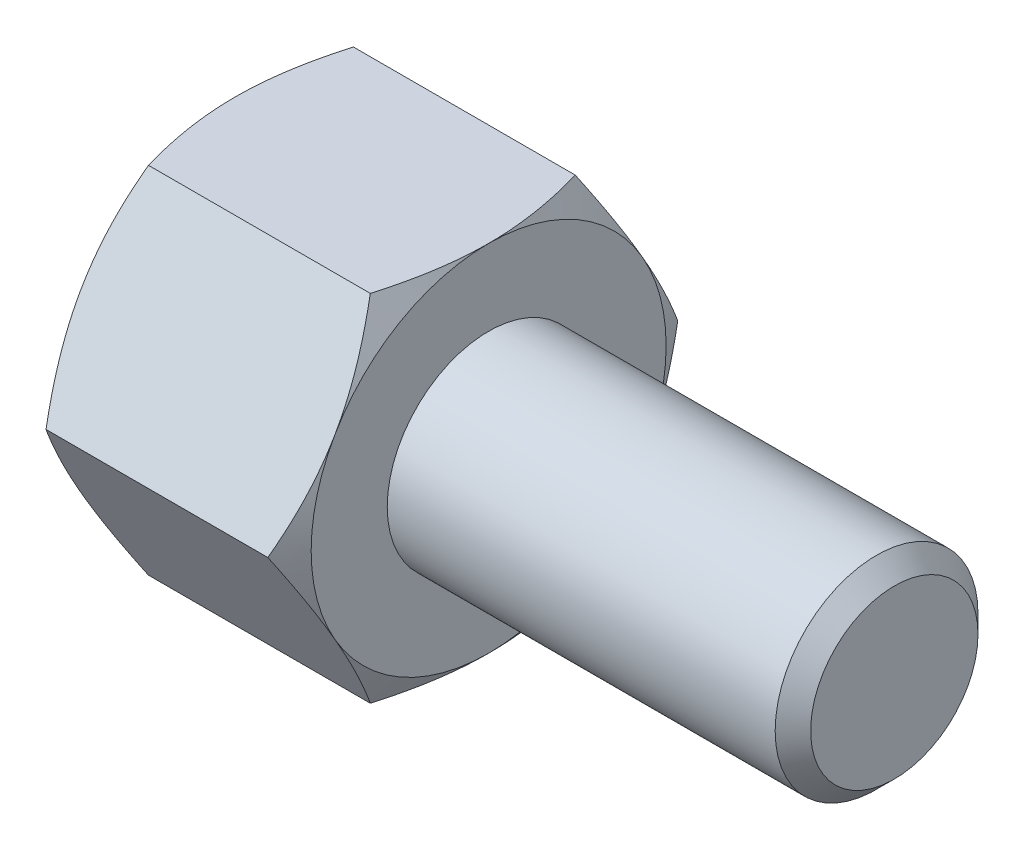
ISO-10303-21;
HEADER;
FILE_DESCRIPTION(('STEP AP214'),'2;1');
FILE_NAME('part.step','',(''),(''),'','','');
FILE_SCHEMA(('AUTOMOTIVE_DESIGN { 1 0 10303 214 1 1 1 1 }'));
ENDSEC;
DATA;
#1=APPLICATION_CONTEXT('core data for automotive mechanical design processes');
#2=APPLICATION_PROTOCOL_DEFINITION('international standard','automotive_design',2000,#1);
#3=PRODUCT_CONTEXT('',#1,'mechanical');
#4=PRODUCT('Part','Part','',(#3));
#5=PRODUCT_RELATED_PRODUCT_CATEGORY('part','',(#4));
#6=PRODUCT_DEFINITION_FORMATION('','',#4);
#7=PRODUCT_DEFINITION_CONTEXT('part definition',#1,'design');
#8=PRODUCT_DEFINITION('design','',#6,#7);
#9=PRODUCT_DEFINITION_SHAPE('','',#8);
#10=(LENGTH_UNIT() NAMED_UNIT(*) SI_UNIT(.MILLI.,.METRE.));
#11=(NAMED_UNIT(*) PLANE_ANGLE_UNIT() SI_UNIT($,.RADIAN.));
#12=(NAMED_UNIT(*) SI_UNIT($,.STERADIAN.) SOLID_ANGLE_UNIT());
#13=UNCERTAINTY_MEASURE_WITH_UNIT(LENGTH_MEASURE(1.E-05),#10,'distance_accuracy_value','');
#14=(GEOMETRIC_REPRESENTATION_CONTEXT(3) GLOBAL_UNCERTAINTY_ASSIGNED_CONTEXT((#13)) GLOBAL_UNIT_ASSIGNED_CONTEXT((#10,
#11,#12)) REPRESENTATION_CONTEXT('',''));
#15=CARTESIAN_POINT('',(0.,0.,0.));
#16=DIRECTION('',(0.,0.,1.));
#17=DIRECTION('',(1.,0.,0.));
#18=AXIS2_PLACEMENT_3D('',#15,#16,#17);
#19=CARTESIAN_POINT('',(2.5,3.5,-2.02072594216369));
#20=DIRECTION('',(1.,0.,0.));
#21=DIRECTION('',(0.,0.,-1.));
#22=AXIS2_PLACEMENT_3D('',#19,#20,#21);
#23=PLANE('',#22);
#24=CARTESIAN_POINT('',(2.5,0.,0.));
#25=DIRECTION('',(1.,0.,0.));
#26=DIRECTION('',(0.,0.,-1.));
#27=AXIS2_PLACEMENT_3D('',#24,#25,#26);
#28=CIRCLE('',#27,3.5);
#29=CARTESIAN_POINT('',(2.5,-1.75,-3.03108891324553));
#30=VERTEX_POINT('',#29);
#31=CARTESIAN_POINT('',(2.5,1.75,-3.03108891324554));
#32=VERTEX_POINT('',#31);
#33=EDGE_CURVE('E288',#30,#32,#28,.T.);
#34=ORIENTED_EDGE('',*,*,#33,.T.);
#35=CARTESIAN_POINT('',(2.5,3.5,0.));
#36=VERTEX_POINT('',#35);
#37=EDGE_CURVE('E53',#32,#36,#28,.T.);
#38=ORIENTED_EDGE('',*,*,#37,.T.);
#39=CARTESIAN_POINT('',(2.5,1.75,3.03108891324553));
#40=VERTEX_POINT('',#39);
#41=EDGE_CURVE('E297',#36,#40,#28,.T.);
#42=ORIENTED_EDGE('',*,*,#41,.T.);
#43=CARTESIAN_POINT('',(2.5,-1.75,3.03108891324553));
#44=VERTEX_POINT('',#43);
#45=EDGE_CURVE('E302',#40,#44,#28,.T.);
#46=ORIENTED_EDGE('',*,*,#45,.T.);
#47=CARTESIAN_POINT('',(2.5,0.,0.));
#48=DIRECTION('',(-1.,0.,0.));
#49=DIRECTION('',(0.,-1.,0.));
#50=AXIS2_PLACEMENT_3D('',#47,#48,#49);
#51=CIRCLE('',#50,3.5);
#52=CARTESIAN_POINT('',(2.5,-3.5,0.));
#53=VERTEX_POINT('',#52);
#54=EDGE_CURVE('E193',#53,#44,#51,.T.);
#55=ORIENTED_EDGE('',*,*,#54,.F.);
#56=EDGE_CURVE('E61',#53,#30,#28,.T.);
#57=ORIENTED_EDGE('',*,*,#56,.T.);
#58=EDGE_LOOP('',(#34,#38,#42,#46,#55,#57));
#59=FACE_BOUND('',#58,.T.);
#60=CARTESIAN_POINT('',(2.5,0.,0.));
#61=DIRECTION('',(1.,0.,0.));
#62=DIRECTION('',(0.,0.,-1.));
#63=AXIS2_PLACEMENT_3D('',#60,#61,#62);
#64=CIRCLE('',#63,2.);
#65=CARTESIAN_POINT('',(2.5,0.,-2.));
#66=VERTEX_POINT('',#65);
#67=EDGE_CURVE('E314',#66,#66,#64,.T.);
#68=ORIENTED_EDGE('',*,*,#67,.F.);
#69=EDGE_LOOP('',(#68));
#70=FACE_BOUND('',#69,.T.);
#71=ADVANCED_FACE('F37',(#59,#70),#23,.T.);
#72=CARTESIAN_POINT('',(2.5,0.,-4.04145188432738));
#73=DIRECTION('',(0.,-0.5,0.866025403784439));
#74=DIRECTION('',(0.,-0.866025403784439,-0.5));
#75=AXIS2_PLACEMENT_3D('',#72,#73,#74);
#76=PLANE('',#75);
#77=CARTESIAN_POINT('',(2.18732593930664,-0.000200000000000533,-4.04156735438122));
#78=CARTESIAN_POINT('',(2.23861421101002,0.153607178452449,-3.9527667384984));
#79=CARTESIAN_POINT('',(2.28525904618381,0.308742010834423,-3.86319960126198));
#80=CARTESIAN_POINT('',(2.36667812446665,0.62169800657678,-3.68251437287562));
#81=CARTESIAN_POINT('',(2.40142356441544,0.779524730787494,-3.59139307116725));
#82=CARTESIAN_POINT('',(2.45550997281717,1.09322221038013,-3.41027974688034));
#83=CARTESIAN_POINT('',(2.47521091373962,1.24904469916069,-3.32031559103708));
#84=CARTESIAN_POINT('',(2.49872986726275,1.56142288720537,-3.13996396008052));
#85=CARTESIAN_POINT('',(2.50256735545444,1.71797745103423,-3.04957714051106));
#86=CARTESIAN_POINT('',(2.49458469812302,2.01050921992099,-2.88068384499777));
#87=CARTESIAN_POINT('',(2.4847245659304,2.1465302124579,-2.80215208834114));
#88=CARTESIAN_POINT('',(2.4534735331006,2.41768602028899,-2.64560020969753));
#89=CARTESIAN_POINT('',(2.43207195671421,2.55281989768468,-2.5675806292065));
#90=CARTESIAN_POINT('',(2.37856959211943,2.82453479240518,-2.41070596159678));
#91=CARTESIAN_POINT('',(2.34624200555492,2.96108141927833,-2.33187072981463));
#92=CARTESIAN_POINT('',(2.27287106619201,3.2321380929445,-2.17537608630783));
#93=CARTESIAN_POINT('',(2.23184495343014,3.36665161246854,-2.09771466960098));
#94=CARTESIAN_POINT('',(2.18732593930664,3.5002,-2.02061047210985));
#95=B_SPLINE_CURVE_WITH_KNOTS('',3,(#77,#78,#79,#80,#81,#82,#83,#84,#85,#86,#87,#88,#89,#90,#91,
#92,#93,#94),.UNSPECIFIED.,.F.,.F.,(4,2,2,2,2,2,2,2,4),(0.,0.554793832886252,1.11092123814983,
1.65328467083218,2.19498204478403,2.6666513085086,3.13875761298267,3.62133612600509,
4.10296698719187),.UNSPECIFIED.);
#96=CARTESIAN_POINT('',(2.18739260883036,0.,-4.04145188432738));
#97=VERTEX_POINT('',#96);
#98=EDGE_CURVE('E319',#97,#32,#95,.T.);
#99=ORIENTED_EDGE('',*,*,#98,.F.);
#100=DIRECTION('',(-1.,0.,0.));
#101=VECTOR('',#100,1.);
#102=CARTESIAN_POINT('',(2.5,0.,-4.04145188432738));
#103=LINE('',#102,#101);
#104=CARTESIAN_POINT('',(-2.18739260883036,0.,-4.04145188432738));
#105=VERTEX_POINT('',#104);
#106=EDGE_CURVE('E264',#97,#105,#103,.T.);
#107=ORIENTED_EDGE('',*,*,#106,.T.);
#108=CARTESIAN_POINT('',(-2.18732593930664,3.5002,-2.02061047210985));
#109=CARTESIAN_POINT('',(-2.23861421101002,3.34639282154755,-2.10941108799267));
#110=CARTESIAN_POINT('',(-2.28525904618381,3.19125798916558,-2.19897822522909));
#111=CARTESIAN_POINT('',(-2.36667812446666,2.87830199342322,-2.37966345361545));
#112=CARTESIAN_POINT('',(-2.40142356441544,2.7204752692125,-2.47078475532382));
#113=CARTESIAN_POINT('',(-2.45550997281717,2.40677778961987,-2.65189807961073));
#114=CARTESIAN_POINT('',(-2.47521091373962,2.25095530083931,-2.74186223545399));
#115=CARTESIAN_POINT('',(-2.49872986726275,1.93857711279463,-2.92221386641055));
#116=CARTESIAN_POINT('',(-2.50256735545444,1.78202254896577,-3.01260068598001));
#117=CARTESIAN_POINT('',(-2.49458469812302,1.48949078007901,-3.1814939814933));
#118=CARTESIAN_POINT('',(-2.4847245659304,1.3534697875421,-3.26002573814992));
#119=CARTESIAN_POINT('',(-2.4534735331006,1.08231397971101,-3.41657761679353));
#120=CARTESIAN_POINT('',(-2.4320719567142,0.947180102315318,-3.49459719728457));
#121=CARTESIAN_POINT('',(-2.37856959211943,0.675465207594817,-3.65147186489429));
#122=CARTESIAN_POINT('',(-2.34624200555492,0.538918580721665,-3.73030709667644));
#123=CARTESIAN_POINT('',(-2.27287106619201,0.267861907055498,-3.88680174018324));
#124=CARTESIAN_POINT('',(-2.23184495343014,0.133348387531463,-3.96446315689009));
#125=CARTESIAN_POINT('',(-2.18732593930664,-0.000200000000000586,-4.04156735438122));
#126=B_SPLINE_CURVE_WITH_KNOTS('',3,(#108,#109,#110,#111,#112,#113,#114,#115,#116,#117,#118,
#119,#120,#121,#122,#123,#124,#125),.UNSPECIFIED.,.F.,.F.,(4,2,2,2,2,2,2,2,4),(0.,
0.554793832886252,1.11092123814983,1.65328467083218,2.19498204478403,2.6666513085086,
3.13875761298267,3.62133612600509,4.10296698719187),.UNSPECIFIED.);
#127=CARTESIAN_POINT('',(-2.5,1.75,-3.03108891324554));
#128=VERTEX_POINT('',#127);
#129=EDGE_CURVE('E324',#128,#105,#126,.T.);
#130=ORIENTED_EDGE('',*,*,#129,.F.);
#131=CARTESIAN_POINT('',(-2.18739260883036,3.5,-2.02072594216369));
#132=VERTEX_POINT('',#131);
#133=EDGE_CURVE('E321',#132,#128,#126,.T.);
#134=ORIENTED_EDGE('',*,*,#133,.F.);
#135=DIRECTION('',(-1.,0.,0.));
#136=VECTOR('',#135,1.);
#137=CARTESIAN_POINT('',(2.5,3.5,-2.02072594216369));
#138=LINE('',#137,#136);
#139=CARTESIAN_POINT('',(2.18739260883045,3.5,-2.02072594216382));
#140=VERTEX_POINT('',#139);
#141=EDGE_CURVE('E279',#140,#132,#138,.T.);
#142=ORIENTED_EDGE('',*,*,#141,.F.);
#143=EDGE_CURVE('E229',#32,#140,#95,.T.);
#144=ORIENTED_EDGE('',*,*,#143,.F.);
#145=EDGE_LOOP('',(#99,#107,#130,#134,#142,#144));
#146=FACE_BOUND('',#145,.T.);
#147=ADVANCED_FACE('F148',(#146),#76,.F.);
#148=CARTESIAN_POINT('',(2.5,3.5,-2.02072594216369));
#149=DIRECTION('',(0.,-1.,0.));
#150=DIRECTION('',(0.,0.,-1.));
#151=AXIS2_PLACEMENT_3D('',#148,#149,#150);
#152=PLANE('',#151);
#153=CARTESIAN_POINT('',(0.744329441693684,3.5,-5.52571367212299));
#154=CARTESIAN_POINT('',(0.819281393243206,3.5,-5.37200190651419));
#155=CARTESIAN_POINT('',(0.893542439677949,3.5,-5.21794762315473));
#156=CARTESIAN_POINT('',(1.04029601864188,3.5,-4.90897223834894));
#157=CARTESIAN_POINT('',(1.11278829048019,3.5,-4.75405101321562));
#158=CARTESIAN_POINT('',(1.25596172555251,3.5,-4.44240758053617));
#159=CARTESIAN_POINT('',(1.32663168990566,3.5,-4.28568021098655));
#160=CARTESIAN_POINT('',(1.46520746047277,3.5,-3.97101270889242));
#161=CARTESIAN_POINT('',(1.53311339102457,3.5,-3.81307263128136));
#162=CARTESIAN_POINT('',(1.66771439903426,3.5,-3.49026114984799));
#163=CARTESIAN_POINT('',(1.73428710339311,3.5,-3.32533845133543));
#164=CARTESIAN_POINT('',(1.86262677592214,3.5,-2.99359992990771));
#165=CARTESIAN_POINT('',(1.92439321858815,3.5,-2.82678390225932));
#166=CARTESIAN_POINT('',(2.04157006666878,3.5,-2.49127529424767));
#167=CARTESIAN_POINT('',(2.09699254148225,3.5,-2.32258697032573));
#168=CARTESIAN_POINT('',(2.19976794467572,3.5,-1.98279215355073));
#169=CARTESIAN_POINT('',(2.24712331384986,3.5,-1.81168640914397));
#170=CARTESIAN_POINT('',(2.33129873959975,3.5,-1.46793354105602));
#171=CARTESIAN_POINT('',(2.36817965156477,3.5,-1.2953015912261));
#172=CARTESIAN_POINT('',(2.42939557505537,3.5,-0.947791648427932));
#173=CARTESIAN_POINT('',(2.453731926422,3.5,-0.772913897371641));
#174=CARTESIAN_POINT('',(2.48760388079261,3.5,-0.424108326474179));
#175=CARTESIAN_POINT('',(2.49733725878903,3.5,-0.250200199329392));
#176=CARTESIAN_POINT('',(2.50170533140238,3.5,0.0978233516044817));
#177=CARTESIAN_POINT('',(2.49633996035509,3.5,0.27193877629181));
#178=CARTESIAN_POINT('',(2.47501181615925,3.5,0.564711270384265));
#179=CARTESIAN_POINT('',(2.46289198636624,3.5,0.683667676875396));
#180=CARTESIAN_POINT('',(2.43230809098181,3.5,0.920767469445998));
#181=CARTESIAN_POINT('',(2.41384324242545,3.5,1.03891075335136));
#182=CARTESIAN_POINT('',(2.34989562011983,3.5,1.39193174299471));
#183=CARTESIAN_POINT('',(2.29586958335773,3.5,1.62528232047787));
#184=CARTESIAN_POINT('',(2.20145152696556,3.5,1.97433825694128));
#185=CARTESIAN_POINT('',(2.16729009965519,3.5,2.09183268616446));
#186=CARTESIAN_POINT('',(2.09523444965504,3.5,2.32568238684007));
#187=CARTESIAN_POINT('',(2.05734019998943,3.5,2.44203765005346));
#188=CARTESIAN_POINT('',(1.97844216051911,3.5,2.67364238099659));
#189=CARTESIAN_POINT('',(1.93743925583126,3.5,2.78889215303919));
#190=CARTESIAN_POINT('',(1.85282457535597,3.5,3.01842460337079));
#191=CARTESIAN_POINT('',(1.8092128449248,3.5,3.1327072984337));
#192=CARTESIAN_POINT('',(1.69582414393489,3.5,3.42150510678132));
#193=CARTESIAN_POINT('',(1.62456360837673,3.5,3.59543696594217));
#194=CARTESIAN_POINT('',(1.47810267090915,3.5,3.94163961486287));
#195=CARTESIAN_POINT('',(1.40290192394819,3.5,4.11391025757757));
#196=CARTESIAN_POINT('',(1.24942525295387,3.5,4.45713072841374));
#197=CARTESIAN_POINT('',(1.17114846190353,3.5,4.62808016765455));
#198=CARTESIAN_POINT('',(1.01218826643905,3.5,4.9688584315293));
#199=CARTESIAN_POINT('',(0.931504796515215,3.5,5.13868722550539));
#200=CARTESIAN_POINT('',(0.686387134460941,3.5,5.64726192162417));
#201=CARTESIAN_POINT('',(0.519097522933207,3.5,5.98463020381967));
#202=CARTESIAN_POINT('',(0.179585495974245,3.5,6.65678495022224));
#203=CARTESIAN_POINT('',(0.0073639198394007,3.5,6.99157184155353));
#204=CARTESIAN_POINT('',(-0.323919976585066,3.5,7.62749570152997));
#205=CARTESIAN_POINT('',(-0.48267007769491,3.5,7.92879562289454));
#206=CARTESIAN_POINT('',(-0.802252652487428,3.5,8.53030635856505));
#207=CARTESIAN_POINT('',(-0.963085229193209,3.5,8.83051711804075));
#208=CARTESIAN_POINT('',(-1.28582073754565,3.5,9.42918006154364));
#209=CARTESIAN_POINT('',(-1.44771890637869,3.5,9.72763481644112));
#210=CARTESIAN_POINT('',(-1.77272623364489,3.5,10.3238577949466));
#211=CARTESIAN_POINT('',(-1.93583530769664,3.5,10.6216260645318));
#212=CARTESIAN_POINT('',(-2.09938958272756,3.5,10.9191478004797));
#213=B_SPLINE_CURVE_WITH_KNOTS('',3,(#153,#154,#155,#156,#157,#158,#159,#160,#161,#162,#163,
#164,#165,#166,#167,#168,#169,#170,#171,#172,#173,#174,#175,#176,#177,#178,#179,#180,#181,#182,
#183,#184,#185,#186,#187,#188,#189,#190,#191,#192,#193,#194,#195,#196,#197,#198,#199,#200,#201,
#202,#203,#204,#205,#206,#207,#208,#209,#210,#211,#212),.UNSPECIFIED.,.F.,.F.,(4,2,2,2,2,2,2,2,
2,2,2,2,2,2,2,2,2,2,2,2,2,2,2,2,2,2,2,2,2,4),(0.,0.513041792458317,1.02615874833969,
1.54190801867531,2.05763406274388,2.59113284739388,3.1246898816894,3.65721433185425,
4.18957737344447,4.71878103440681,5.247928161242,5.76984197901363,6.29175806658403,
6.65030258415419,7.0088913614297,7.72642330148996,8.09346920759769,8.46051776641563,
8.82746220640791,9.19440026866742,9.7582223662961,10.3220939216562,10.8861255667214,
11.4501725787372,12.579801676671,13.7092396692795,14.730918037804,15.7526471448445,
16.771258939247,17.7898004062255),.UNSPECIFIED.);
#214=EDGE_CURVE('E227',#140,#36,#213,.T.);
#215=ORIENTED_EDGE('',*,*,#214,.F.);
#216=ORIENTED_EDGE('',*,*,#141,.T.);
#217=CARTESIAN_POINT('',(-0.744329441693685,3.5,-5.52571367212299));
#218=CARTESIAN_POINT('',(-0.819281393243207,3.5,-5.37200190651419));
#219=CARTESIAN_POINT('',(-0.89354243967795,3.5,-5.21794762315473));
#220=CARTESIAN_POINT('',(-1.04029601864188,3.5,-4.90897223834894));
#221=CARTESIAN_POINT('',(-1.11278829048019,3.5,-4.75405101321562));
#222=CARTESIAN_POINT('',(-1.25596172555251,3.5,-4.44240758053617));
#223=CARTESIAN_POINT('',(-1.32663168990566,3.5,-4.28568021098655));
#224=CARTESIAN_POINT('',(-1.46520746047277,3.5,-3.97101270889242));
#225=CARTESIAN_POINT('',(-1.53311339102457,3.5,-3.81307263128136));
#226=CARTESIAN_POINT('',(-1.66771439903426,3.5,-3.49026114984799));
#227=CARTESIAN_POINT('',(-1.73428710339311,3.5,-3.32533845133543));
#228=CARTESIAN_POINT('',(-1.86262677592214,3.5,-2.99359992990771));
#229=CARTESIAN_POINT('',(-1.92439321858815,3.5,-2.82678390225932));
#230=CARTESIAN_POINT('',(-2.04157006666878,3.5,-2.49127529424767));
#231=CARTESIAN_POINT('',(-2.09699254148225,3.5,-2.32258697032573));
#232=CARTESIAN_POINT('',(-2.19976794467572,3.5,-1.98279215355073));
#233=CARTESIAN_POINT('',(-2.24712331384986,3.5,-1.81168640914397));
#234=CARTESIAN_POINT('',(-2.33129873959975,3.5,-1.46793354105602));
#235=CARTESIAN_POINT('',(-2.36817965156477,3.5,-1.2953015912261));
#236=CARTESIAN_POINT('',(-2.42939557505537,3.5,-0.947791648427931));
#237=CARTESIAN_POINT('',(-2.453731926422,3.5,-0.77291389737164));
#238=CARTESIAN_POINT('',(-2.48760388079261,3.5,-0.424108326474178));
#239=CARTESIAN_POINT('',(-2.49733725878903,3.5,-0.250200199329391));
#240=CARTESIAN_POINT('',(-2.50170533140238,3.5,0.0978233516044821));
#241=CARTESIAN_POINT('',(-2.49633996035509,3.5,0.27193877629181));
#242=CARTESIAN_POINT('',(-2.47501181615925,3.5,0.564711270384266));
#243=CARTESIAN_POINT('',(-2.46289198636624,3.5,0.683667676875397));
#244=CARTESIAN_POINT('',(-2.43230809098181,3.5,0.920767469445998));
#245=CARTESIAN_POINT('',(-2.41384324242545,3.5,1.03891075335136));
#246=CARTESIAN_POINT('',(-2.34989562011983,3.5,1.39193174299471));
#247=CARTESIAN_POINT('',(-2.29586958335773,3.5,1.62528232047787));
#248=CARTESIAN_POINT('',(-2.20145152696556,3.5,1.97433825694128));
#249=CARTESIAN_POINT('',(-2.16729009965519,3.5,2.09183268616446));
#250=CARTESIAN_POINT('',(-2.09523444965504,3.5,2.32568238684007));
#251=CARTESIAN_POINT('',(-2.05734019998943,3.5,2.44203765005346));
#252=CARTESIAN_POINT('',(-1.97844216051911,3.5,2.67364238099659));
#253=CARTESIAN_POINT('',(-1.93743925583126,3.5,2.78889215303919));
#254=CARTESIAN_POINT('',(-1.85282457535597,3.5,3.01842460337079));
#255=CARTESIAN_POINT('',(-1.8092128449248,3.5,3.1327072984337));
#256=CARTESIAN_POINT('',(-1.69582414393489,3.5,3.42150510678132));
#257=CARTESIAN_POINT('',(-1.62456360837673,3.5,3.59543696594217));
#258=CARTESIAN_POINT('',(-1.47810267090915,3.5,3.94163961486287));
#259=CARTESIAN_POINT('',(-1.40290192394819,3.5,4.11391025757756));
#260=CARTESIAN_POINT('',(-1.24942525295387,3.5,4.45713072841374));
#261=CARTESIAN_POINT('',(-1.17114846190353,3.5,4.62808016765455));
#262=CARTESIAN_POINT('',(-1.01218826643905,3.5,4.9688584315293));
#263=CARTESIAN_POINT('',(-0.931504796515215,3.5,5.13868722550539));
#264=CARTESIAN_POINT('',(-0.68638713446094,3.5,5.64726192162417));
#265=CARTESIAN_POINT('',(-0.519097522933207,3.5,5.98463020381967));
#266=CARTESIAN_POINT('',(-0.179585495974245,3.5,6.65678495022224));
#267=CARTESIAN_POINT('',(-0.00736391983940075,3.5,6.99157184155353));
#268=CARTESIAN_POINT('',(0.323919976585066,3.5,7.62749570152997));
#269=CARTESIAN_POINT('',(0.48267007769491,3.5,7.92879562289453));
#270=CARTESIAN_POINT('',(0.802252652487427,3.5,8.53030635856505));
#271=CARTESIAN_POINT('',(0.963085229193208,3.5,8.83051711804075));
#272=CARTESIAN_POINT('',(1.28582073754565,3.5,9.42918006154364));
#273=CARTESIAN_POINT('',(1.44771890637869,3.5,9.72763481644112));
#274=CARTESIAN_POINT('',(1.77272623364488,3.5,10.3238577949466));
#275=CARTESIAN_POINT('',(1.93583530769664,3.5,10.6216260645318));
#276=CARTESIAN_POINT('',(2.09938958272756,3.5,10.9191478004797));
#277=B_SPLINE_CURVE_WITH_KNOTS('',3,(#217,#218,#219,#220,#221,#222,#223,#224,#225,#226,#227,
#228,#229,#230,#231,#232,#233,#234,#235,#236,#237,#238,#239,#240,#241,#242,#243,#244,#245,#246,
#247,#248,#249,#250,#251,#252,#253,#254,#255,#256,#257,#258,#259,#260,#261,#262,#263,#264,#265,
#266,#267,#268,#269,#270,#271,#272,#273,#274,#275,#276),.UNSPECIFIED.,.F.,.F.,(4,2,2,2,2,2,2,2,
2,2,2,2,2,2,2,2,2,2,2,2,2,2,2,2,2,2,2,2,2,4),(0.,0.513041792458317,1.02615874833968,
1.5419080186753,2.05763406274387,2.59113284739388,3.1246898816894,3.65721433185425,
4.18957737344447,4.71878103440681,5.247928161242,5.76984197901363,6.29175806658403,
6.65030258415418,7.0088913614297,7.72642330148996,8.09346920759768,8.46051776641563,
8.82746220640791,9.19440026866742,9.75822236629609,10.3220939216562,10.8861255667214,
11.4501725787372,12.579801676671,13.7092396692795,14.730918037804,15.7526471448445,
16.7712589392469,17.7898004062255),.UNSPECIFIED.);
#278=CARTESIAN_POINT('',(-2.5,3.5,0.));
#279=VERTEX_POINT('',#278);
#280=EDGE_CURVE('E241',#279,#132,#277,.F.);
#281=ORIENTED_EDGE('',*,*,#280,.F.);
#282=CARTESIAN_POINT('',(-2.18739260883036,3.5,2.02072594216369));
#283=VERTEX_POINT('',#282);
#284=EDGE_CURVE('E249',#283,#279,#277,.F.);
#285=ORIENTED_EDGE('',*,*,#284,.F.);
#286=DIRECTION('',(-1.,0.,0.));
#287=VECTOR('',#286,1.);
#288=CARTESIAN_POINT('',(2.5,3.5,2.02072594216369));
#289=LINE('',#288,#287);
#290=CARTESIAN_POINT('',(2.18739260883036,3.5,2.02072594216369));
#291=VERTEX_POINT('',#290);
#292=EDGE_CURVE('E276',#291,#283,#289,.T.);
#293=ORIENTED_EDGE('',*,*,#292,.F.);
#294=EDGE_CURVE('E221',#36,#291,#213,.T.);
#295=ORIENTED_EDGE('',*,*,#294,.F.);
#296=EDGE_LOOP('',(#215,#216,#281,#285,#293,#295));
#297=FACE_BOUND('',#296,.T.);
#298=ADVANCED_FACE('F153',(#297),#152,.F.);
#299=CARTESIAN_POINT('',(2.5,3.5,2.02072594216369));
#300=DIRECTION('',(0.,-0.5,-0.866025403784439));
#301=DIRECTION('',(0.,0.866025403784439,-0.5));
#302=AXIS2_PLACEMENT_3D('',#299,#300,#301);
#303=PLANE('',#302);
#304=CARTESIAN_POINT('',(2.18732593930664,3.5002,2.02061047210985));
#305=CARTESIAN_POINT('',(2.23861421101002,3.34639282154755,2.10941108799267));
#306=CARTESIAN_POINT('',(2.28525904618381,3.19125798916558,2.19897822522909));
#307=CARTESIAN_POINT('',(2.36667812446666,2.87830199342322,2.37966345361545));
#308=CARTESIAN_POINT('',(2.40142356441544,2.7204752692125,2.47078475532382));
#309=CARTESIAN_POINT('',(2.45550997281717,2.40677778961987,2.65189807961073));
#310=CARTESIAN_POINT('',(2.47521091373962,2.25095530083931,2.74186223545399));
#311=CARTESIAN_POINT('',(2.49872986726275,1.93857711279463,2.92221386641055));
#312=CARTESIAN_POINT('',(2.50256735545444,1.78202254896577,3.01260068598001));
#313=CARTESIAN_POINT('',(2.49458469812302,1.48949078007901,3.1814939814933));
#314=CARTESIAN_POINT('',(2.48472456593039,1.35346978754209,3.26002573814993));
#315=CARTESIAN_POINT('',(2.4534735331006,1.08231397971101,3.41657761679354));
#316=CARTESIAN_POINT('',(2.4320719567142,0.947180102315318,3.49459719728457));
#317=CARTESIAN_POINT('',(2.37856959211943,0.675465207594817,3.65147186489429));
#318=CARTESIAN_POINT('',(2.34624200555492,0.538918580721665,3.73030709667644));
#319=CARTESIAN_POINT('',(2.27287106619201,0.267861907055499,3.88680174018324));
#320=CARTESIAN_POINT('',(2.23184495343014,0.133348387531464,3.96446315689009));
#321=CARTESIAN_POINT('',(2.18732593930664,-0.000199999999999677,4.04156735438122));
#322=B_SPLINE_CURVE_WITH_KNOTS('',3,(#304,#305,#306,#307,#308,#309,#310,#311,#312,#313,#314,
#315,#316,#317,#318,#319,#320,#321),.UNSPECIFIED.,.F.,.F.,(4,2,2,2,2,2,2,2,4),(0.,
0.554793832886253,1.11092123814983,1.65328467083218,2.19498204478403,2.6666513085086,
3.13875761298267,3.62133612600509,4.10296698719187),.UNSPECIFIED.);
#323=EDGE_CURVE('E228',#291,#40,#322,.T.);
#324=ORIENTED_EDGE('',*,*,#323,.F.);
#325=ORIENTED_EDGE('',*,*,#292,.T.);
#326=CARTESIAN_POINT('',(-2.18732593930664,-0.00019999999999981,4.04156735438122));
#327=CARTESIAN_POINT('',(-2.23861421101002,0.153607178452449,3.9527667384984));
#328=CARTESIAN_POINT('',(-2.28525904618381,0.308742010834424,3.86319960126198));
#329=CARTESIAN_POINT('',(-2.36667812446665,0.621698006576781,3.68251437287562));
#330=CARTESIAN_POINT('',(-2.40142356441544,0.779524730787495,3.59139307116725));
#331=CARTESIAN_POINT('',(-2.45550997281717,1.09322221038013,3.41027974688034));
#332=CARTESIAN_POINT('',(-2.47521091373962,1.24904469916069,3.32031559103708));
#333=CARTESIAN_POINT('',(-2.49872986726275,1.56142288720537,3.13996396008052));
#334=CARTESIAN_POINT('',(-2.50256735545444,1.71797745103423,3.04957714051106));
#335=CARTESIAN_POINT('',(-2.49458469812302,2.01050921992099,2.88068384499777));
#336=CARTESIAN_POINT('',(-2.4847245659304,2.1465302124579,2.80215208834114));
#337=CARTESIAN_POINT('',(-2.4534735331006,2.41768602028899,2.64560020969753));
#338=CARTESIAN_POINT('',(-2.4320719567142,2.55281989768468,2.5675806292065));
#339=CARTESIAN_POINT('',(-2.37856959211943,2.82453479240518,2.41070596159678));
#340=CARTESIAN_POINT('',(-2.34624200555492,2.96108141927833,2.33187072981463));
#341=CARTESIAN_POINT('',(-2.27287106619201,3.2321380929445,2.17537608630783));
#342=CARTESIAN_POINT('',(-2.23184495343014,3.36665161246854,2.09771466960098));
#343=CARTESIAN_POINT('',(-2.18732593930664,3.5002,2.02061047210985));
#344=B_SPLINE_CURVE_WITH_KNOTS('',3,(#326,#327,#328,#329,#330,#331,#332,#333,#334,#335,#336,
#337,#338,#339,#340,#341,#342,#343),.UNSPECIFIED.,.F.,.F.,(4,2,2,2,2,2,2,2,4),(0.,
0.554793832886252,1.11092123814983,1.65328467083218,2.19498204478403,2.6666513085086,
3.13875761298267,3.62133612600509,4.10296698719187),.UNSPECIFIED.);
#345=CARTESIAN_POINT('',(-2.5,1.75,3.03108891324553));
#346=VERTEX_POINT('',#345);
#347=EDGE_CURVE('E255',#346,#283,#344,.T.);
#348=ORIENTED_EDGE('',*,*,#347,.F.);
#349=CARTESIAN_POINT('',(-2.18739260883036,0.,4.04145188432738));
#350=VERTEX_POINT('',#349);
#351=EDGE_CURVE('E262',#350,#346,#344,.T.);
#352=ORIENTED_EDGE('',*,*,#351,.F.);
#353=DIRECTION('',(-1.,0.,0.));
#354=VECTOR('',#353,1.);
#355=CARTESIAN_POINT('',(2.5,0.,4.04145188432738));
#356=LINE('',#355,#354);
#357=CARTESIAN_POINT('',(2.18739260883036,0.,4.04145188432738));
#358=VERTEX_POINT('',#357);
#359=EDGE_CURVE('E273',#358,#350,#356,.T.);
#360=ORIENTED_EDGE('',*,*,#359,.F.);
#361=EDGE_CURVE('E215',#40,#358,#322,.T.);
#362=ORIENTED_EDGE('',*,*,#361,.F.);
#363=EDGE_LOOP('',(#324,#325,#348,#352,#360,#362));
#364=FACE_BOUND('',#363,.T.);
#365=ADVANCED_FACE('F235',(#364),#303,.F.);
#366=CARTESIAN_POINT('',(2.5,0.,4.04145188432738));
#367=DIRECTION('',(0.,0.5,-0.866025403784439));
#368=DIRECTION('',(0.,0.866025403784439,0.5));
#369=AXIS2_PLACEMENT_3D('',#366,#367,#368);
#370=PLANE('',#369);
#371=CARTESIAN_POINT('',(2.18732593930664,0.000200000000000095,4.04156735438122));
#372=CARTESIAN_POINT('',(2.23861421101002,-0.153607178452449,3.9527667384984));
#373=CARTESIAN_POINT('',(2.28525904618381,-0.308742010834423,3.86319960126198));
#374=CARTESIAN_POINT('',(2.36667812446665,-0.62169800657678,3.68251437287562));
#375=CARTESIAN_POINT('',(2.40142356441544,-0.779524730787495,3.59139307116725));
#376=CARTESIAN_POINT('',(2.45550997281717,-1.09322221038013,3.41027974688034));
#377=CARTESIAN_POINT('',(2.47521091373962,-1.24904469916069,3.32031559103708));
#378=CARTESIAN_POINT('',(2.49872986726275,-1.56142288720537,3.13996396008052));
#379=CARTESIAN_POINT('',(2.50256735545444,-1.71797745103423,3.04957714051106));
#380=CARTESIAN_POINT('',(2.49458469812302,-2.01050921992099,2.88068384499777));
#381=CARTESIAN_POINT('',(2.48472456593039,-2.1465302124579,2.80215208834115));
#382=CARTESIAN_POINT('',(2.4534735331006,-2.41768602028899,2.64560020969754));
#383=CARTESIAN_POINT('',(2.4320719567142,-2.55281989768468,2.5675806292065));
#384=CARTESIAN_POINT('',(2.37856959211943,-2.82453479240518,2.41070596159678));
#385=CARTESIAN_POINT('',(2.34624200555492,-2.96108141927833,2.33187072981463));
#386=CARTESIAN_POINT('',(2.27287106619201,-3.2321380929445,2.17537608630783));
#387=CARTESIAN_POINT('',(2.23184495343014,-3.36665161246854,2.09771466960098));
#388=CARTESIAN_POINT('',(2.18732593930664,-3.5002,2.02061047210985));
#389=B_SPLINE_CURVE_WITH_KNOTS('',3,(#371,#372,#373,#374,#375,#376,#377,#378,#379,#380,#381,
#382,#383,#384,#385,#386,#387,#388),.UNSPECIFIED.,.F.,.F.,(4,2,2,2,2,2,2,2,4),(0.,
0.554793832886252,1.11092123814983,1.65328467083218,2.19498204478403,2.6666513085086,
3.13875761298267,3.62133612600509,4.10296698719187),.UNSPECIFIED.);
#390=EDGE_CURVE('E328',#358,#44,#389,.T.);
#391=ORIENTED_EDGE('',*,*,#390,.F.);
#392=ORIENTED_EDGE('',*,*,#359,.T.);
#393=CARTESIAN_POINT('',(-2.18732593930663,-3.5002,2.02061047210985));
#394=CARTESIAN_POINT('',(-2.23861421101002,-3.34639282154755,2.10941108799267));
#395=CARTESIAN_POINT('',(-2.28525904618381,-3.19125798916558,2.19897822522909));
#396=CARTESIAN_POINT('',(-2.36667812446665,-2.87830199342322,2.37966345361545));
#397=CARTESIAN_POINT('',(-2.40142356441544,-2.7204752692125,2.47078475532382));
#398=CARTESIAN_POINT('',(-2.45550997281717,-2.40677778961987,2.65189807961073));
#399=CARTESIAN_POINT('',(-2.47521091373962,-2.25095530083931,2.74186223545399));
#400=CARTESIAN_POINT('',(-2.49872986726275,-1.93857711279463,2.92221386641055));
#401=CARTESIAN_POINT('',(-2.50256735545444,-1.78202254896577,3.01260068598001));
#402=CARTESIAN_POINT('',(-2.49458469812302,-1.48949078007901,3.1814939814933));
#403=CARTESIAN_POINT('',(-2.48472456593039,-1.3534697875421,3.26002573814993));
#404=CARTESIAN_POINT('',(-2.4534735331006,-1.08231397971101,3.41657761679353));
#405=CARTESIAN_POINT('',(-2.4320719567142,-0.947180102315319,3.49459719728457));
#406=CARTESIAN_POINT('',(-2.37856959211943,-0.675465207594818,3.65147186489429));
#407=CARTESIAN_POINT('',(-2.34624200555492,-0.538918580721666,3.73030709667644));
#408=CARTESIAN_POINT('',(-2.27287106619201,-0.267861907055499,3.88680174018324));
#409=CARTESIAN_POINT('',(-2.23184495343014,-0.133348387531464,3.96446315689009));
#410=CARTESIAN_POINT('',(-2.18732593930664,0.000199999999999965,4.04156735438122));
#411=B_SPLINE_CURVE_WITH_KNOTS('',3,(#393,#394,#395,#396,#397,#398,#399,#400,#401,#402,#403,
#404,#405,#406,#407,#408,#409,#410),.UNSPECIFIED.,.F.,.F.,(4,2,2,2,2,2,2,2,4),(0.,
0.554793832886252,1.11092123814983,1.65328467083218,2.19498204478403,2.6666513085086,
3.13875761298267,3.62133612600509,4.10296698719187),.UNSPECIFIED.);
#412=CARTESIAN_POINT('',(-2.5,-1.75,3.03108891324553));
#413=VERTEX_POINT('',#412);
#414=EDGE_CURVE('E263',#413,#350,#411,.T.);
#415=ORIENTED_EDGE('',*,*,#414,.F.);
#416=CARTESIAN_POINT('',(-2.18739260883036,-3.5,2.02072594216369));
#417=VERTEX_POINT('',#416);
#418=EDGE_CURVE('E250',#417,#413,#411,.T.);
#419=ORIENTED_EDGE('',*,*,#418,.F.);
#420=DIRECTION('',(-1.,0.,0.));
#421=VECTOR('',#420,1.);
#422=CARTESIAN_POINT('',(2.5,-3.5,2.02072594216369));
#423=LINE('',#422,#421);
#424=CARTESIAN_POINT('',(2.18739260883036,-3.5,2.02072594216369));
#425=VERTEX_POINT('',#424);
#426=EDGE_CURVE('E270',#425,#417,#423,.T.);
#427=ORIENTED_EDGE('',*,*,#426,.F.);
#428=EDGE_CURVE('E210',#44,#425,#389,.T.);
#429=ORIENTED_EDGE('',*,*,#428,.F.);
#430=EDGE_LOOP('',(#391,#392,#415,#419,#427,#429));
#431=FACE_BOUND('',#430,.T.);
#432=ADVANCED_FACE('F418',(#431),#370,.F.);
#433=CARTESIAN_POINT('',(2.5,-3.5,2.02072594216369));
#434=DIRECTION('',(0.,1.,0.));
#435=DIRECTION('',(0.,0.,1.));
#436=AXIS2_PLACEMENT_3D('',#433,#434,#435);
#437=PLANE('',#436);
#438=CARTESIAN_POINT('',(0.744329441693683,-3.5,-5.52571367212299));
#439=CARTESIAN_POINT('',(0.819281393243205,-3.5,-5.37200190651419));
#440=CARTESIAN_POINT('',(0.893542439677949,-3.5,-5.21794762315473));
#441=CARTESIAN_POINT('',(1.04029601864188,-3.5,-4.90897223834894));
#442=CARTESIAN_POINT('',(1.11278829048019,-3.5,-4.75405101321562));
#443=CARTESIAN_POINT('',(1.25596172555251,-3.5,-4.44240758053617));
#444=CARTESIAN_POINT('',(1.32663168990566,-3.5,-4.28568021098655));
#445=CARTESIAN_POINT('',(1.46520746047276,-3.5,-3.97101270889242));
#446=CARTESIAN_POINT('',(1.53311339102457,-3.5,-3.81307263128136));
#447=CARTESIAN_POINT('',(1.66771439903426,-3.5,-3.49026114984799));
#448=CARTESIAN_POINT('',(1.73428710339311,-3.5,-3.32533845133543));
#449=CARTESIAN_POINT('',(1.86262677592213,-3.5,-2.99359992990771));
#450=CARTESIAN_POINT('',(1.92439321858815,-3.5,-2.82678390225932));
#451=CARTESIAN_POINT('',(2.04157006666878,-3.5,-2.49127529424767));
#452=CARTESIAN_POINT('',(2.09699254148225,-3.5,-2.32258697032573));
#453=CARTESIAN_POINT('',(2.19976794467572,-3.5,-1.98279215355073));
#454=CARTESIAN_POINT('',(2.24712331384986,-3.5,-1.81168640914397));
#455=CARTESIAN_POINT('',(2.33129873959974,-3.5,-1.46793354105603));
#456=CARTESIAN_POINT('',(2.36817965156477,-3.5,-1.2953015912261));
#457=CARTESIAN_POINT('',(2.42939557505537,-3.5,-0.947791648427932));
#458=CARTESIAN_POINT('',(2.453731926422,-3.5,-0.772913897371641));
#459=CARTESIAN_POINT('',(2.48760388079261,-3.5,-0.424108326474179));
#460=CARTESIAN_POINT('',(2.49733725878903,-3.5,-0.250200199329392));
#461=CARTESIAN_POINT('',(2.50170533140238,-3.5,0.0978233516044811));
#462=CARTESIAN_POINT('',(2.49633996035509,-3.5,0.271938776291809));
#463=CARTESIAN_POINT('',(2.47501181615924,-3.5,0.564711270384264));
#464=CARTESIAN_POINT('',(2.46289198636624,-3.5,0.683667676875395));
#465=CARTESIAN_POINT('',(2.43230809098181,-3.5,0.920767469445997));
#466=CARTESIAN_POINT('',(2.41384324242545,-3.5,1.03891075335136));
#467=CARTESIAN_POINT('',(2.34989562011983,-3.5,1.39193174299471));
#468=CARTESIAN_POINT('',(2.29586958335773,-3.5,1.62528232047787));
#469=CARTESIAN_POINT('',(2.20145152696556,-3.5,1.97433825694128));
#470=CARTESIAN_POINT('',(2.16729009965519,-3.5,2.09183268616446));
#471=CARTESIAN_POINT('',(2.09523444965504,-3.5,2.32568238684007));
#472=CARTESIAN_POINT('',(2.05734019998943,-3.5,2.44203765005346));
#473=CARTESIAN_POINT('',(1.97844216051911,-3.5,2.67364238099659));
#474=CARTESIAN_POINT('',(1.93743925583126,-3.5,2.78889215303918));
#475=CARTESIAN_POINT('',(1.85282457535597,-3.5,3.01842460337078));
#476=CARTESIAN_POINT('',(1.8092128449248,-3.5,3.13270729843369));
#477=CARTESIAN_POINT('',(1.69582414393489,-3.5,3.42150510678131));
#478=CARTESIAN_POINT('',(1.62456360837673,-3.5,3.59543696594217));
#479=CARTESIAN_POINT('',(1.47810267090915,-3.5,3.94163961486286));
#480=CARTESIAN_POINT('',(1.40290192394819,-3.5,4.11391025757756));
#481=CARTESIAN_POINT('',(1.24942525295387,-3.5,4.45713072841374));
#482=CARTESIAN_POINT('',(1.17114846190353,-3.5,4.62808016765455));
#483=CARTESIAN_POINT('',(1.01218826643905,-3.5,4.9688584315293));
#484=CARTESIAN_POINT('',(0.931504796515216,-3.5,5.13868722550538));
#485=CARTESIAN_POINT('',(0.686387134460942,-3.5,5.64726192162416));
#486=CARTESIAN_POINT('',(0.519097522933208,-3.5,5.98463020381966));
#487=CARTESIAN_POINT('',(0.179585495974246,-3.5,6.65678495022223));
#488=CARTESIAN_POINT('',(0.00736391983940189,-3.5,6.99157184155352));
#489=CARTESIAN_POINT('',(-0.323919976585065,-3.5,7.62749570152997));
#490=CARTESIAN_POINT('',(-0.482670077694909,-3.5,7.92879562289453));
#491=CARTESIAN_POINT('',(-0.802252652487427,-3.5,8.53030635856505));
#492=CARTESIAN_POINT('',(-0.963085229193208,-3.5,8.83051711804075));
#493=CARTESIAN_POINT('',(-1.28582073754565,-3.5,9.42918006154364));
#494=CARTESIAN_POINT('',(-1.44771890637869,-3.5,9.72763481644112));
#495=CARTESIAN_POINT('',(-1.77272623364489,-3.5,10.3238577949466));
#496=CARTESIAN_POINT('',(-1.93583530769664,-3.5,10.6216260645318));
#497=CARTESIAN_POINT('',(-2.09938958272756,-3.5,10.9191478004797));
#498=B_SPLINE_CURVE_WITH_KNOTS('',3,(#438,#439,#440,#441,#442,#443,#444,#445,#446,#447,#448,
#449,#450,#451,#452,#453,#454,#455,#456,#457,#458,#459,#460,#461,#462,#463,#464,#465,#466,#467,
#468,#469,#470,#471,#472,#473,#474,#475,#476,#477,#478,#479,#480,#481,#482,#483,#484,#485,#486,
#487,#488,#489,#490,#491,#492,#493,#494,#495,#496,#497),.UNSPECIFIED.,.F.,.F.,(4,2,2,2,2,2,2,2,
2,2,2,2,2,2,2,2,2,2,2,2,2,2,2,2,2,2,2,2,2,4),(0.,0.513041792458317,1.02615874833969,
1.5419080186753,2.05763406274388,2.59113284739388,3.1246898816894,3.65721433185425,
4.18957737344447,4.71878103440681,5.247928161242,5.76984197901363,6.29175806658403,
6.65030258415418,7.0088913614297,7.72642330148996,8.09346920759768,8.46051776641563,
8.8274622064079,9.19440026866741,9.75822236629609,10.3220939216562,10.8861255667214,
11.4501725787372,12.579801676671,13.7092396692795,14.730918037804,15.7526471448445,
16.7712589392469,17.7898004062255),.UNSPECIFIED.);
#499=EDGE_CURVE('E334',#425,#53,#498,.F.);
#500=ORIENTED_EDGE('',*,*,#499,.F.);
#501=ORIENTED_EDGE('',*,*,#426,.T.);
#502=CARTESIAN_POINT('',(-0.744329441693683,-3.5,-5.52571367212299));
#503=CARTESIAN_POINT('',(-0.819281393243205,-3.5,-5.37200190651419));
#504=CARTESIAN_POINT('',(-0.893542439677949,-3.5,-5.21794762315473));
#505=CARTESIAN_POINT('',(-1.04029601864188,-3.5,-4.90897223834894));
#506=CARTESIAN_POINT('',(-1.11278829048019,-3.5,-4.75405101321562));
#507=CARTESIAN_POINT('',(-1.25596172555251,-3.5,-4.44240758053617));
#508=CARTESIAN_POINT('',(-1.32663168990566,-3.5,-4.28568021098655));
#509=CARTESIAN_POINT('',(-1.46520746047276,-3.5,-3.97101270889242));
#510=CARTESIAN_POINT('',(-1.53311339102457,-3.5,-3.81307263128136));
#511=CARTESIAN_POINT('',(-1.66771439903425,-3.5,-3.49026114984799));
#512=CARTESIAN_POINT('',(-1.73428710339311,-3.5,-3.32533845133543));
#513=CARTESIAN_POINT('',(-1.86262677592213,-3.5,-2.99359992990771));
#514=CARTESIAN_POINT('',(-1.92439321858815,-3.5,-2.82678390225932));
#515=CARTESIAN_POINT('',(-2.04157006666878,-3.5,-2.49127529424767));
#516=CARTESIAN_POINT('',(-2.09699254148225,-3.5,-2.32258697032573));
#517=CARTESIAN_POINT('',(-2.19976794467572,-3.5,-1.98279215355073));
#518=CARTESIAN_POINT('',(-2.24712331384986,-3.5,-1.81168640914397));
#519=CARTESIAN_POINT('',(-2.33129873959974,-3.5,-1.46793354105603));
#520=CARTESIAN_POINT('',(-2.36817965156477,-3.5,-1.2953015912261));
#521=CARTESIAN_POINT('',(-2.42939557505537,-3.5,-0.947791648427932));
#522=CARTESIAN_POINT('',(-2.453731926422,-3.5,-0.772913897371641));
#523=CARTESIAN_POINT('',(-2.48760388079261,-3.5,-0.424108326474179));
#524=CARTESIAN_POINT('',(-2.49733725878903,-3.5,-0.250200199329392));
#525=CARTESIAN_POINT('',(-2.50170533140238,-3.5,0.0978233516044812));
#526=CARTESIAN_POINT('',(-2.49633996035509,-3.5,0.271938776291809));
#527=CARTESIAN_POINT('',(-2.47501181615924,-3.5,0.564711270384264));
#528=CARTESIAN_POINT('',(-2.46289198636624,-3.5,0.683667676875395));
#529=CARTESIAN_POINT('',(-2.43230809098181,-3.5,0.920767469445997));
#530=CARTESIAN_POINT('',(-2.41384324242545,-3.5,1.03891075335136));
#531=CARTESIAN_POINT('',(-2.34989562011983,-3.5,1.39193174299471));
#532=CARTESIAN_POINT('',(-2.29586958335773,-3.5,1.62528232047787));
#533=CARTESIAN_POINT('',(-2.20145152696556,-3.5,1.97433825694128));
#534=CARTESIAN_POINT('',(-2.16729009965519,-3.5,2.09183268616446));
#535=CARTESIAN_POINT('',(-2.09523444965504,-3.5,2.32568238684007));
#536=CARTESIAN_POINT('',(-2.05734019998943,-3.5,2.44203765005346));
#537=CARTESIAN_POINT('',(-1.97844216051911,-3.5,2.67364238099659));
#538=CARTESIAN_POINT('',(-1.93743925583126,-3.5,2.78889215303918));
#539=CARTESIAN_POINT('',(-1.85282457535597,-3.5,3.01842460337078));
#540=CARTESIAN_POINT('',(-1.8092128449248,-3.5,3.13270729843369));
#541=CARTESIAN_POINT('',(-1.69582414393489,-3.5,3.42150510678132));
#542=CARTESIAN_POINT('',(-1.62456360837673,-3.5,3.59543696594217));
#543=CARTESIAN_POINT('',(-1.47810267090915,-3.5,3.94163961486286));
#544=CARTESIAN_POINT('',(-1.40290192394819,-3.5,4.11391025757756));
#545=CARTESIAN_POINT('',(-1.24942525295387,-3.5,4.45713072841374));
#546=CARTESIAN_POINT('',(-1.17114846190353,-3.5,4.62808016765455));
#547=CARTESIAN_POINT('',(-1.01218826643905,-3.5,4.9688584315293));
#548=CARTESIAN_POINT('',(-0.931504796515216,-3.5,5.13868722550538));
#549=CARTESIAN_POINT('',(-0.686387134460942,-3.5,5.64726192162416));
#550=CARTESIAN_POINT('',(-0.519097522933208,-3.5,5.98463020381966));
#551=CARTESIAN_POINT('',(-0.179585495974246,-3.5,6.65678495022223));
#552=CARTESIAN_POINT('',(-0.00736391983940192,-3.5,6.99157184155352));
#553=CARTESIAN_POINT('',(0.323919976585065,-3.5,7.62749570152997));
#554=CARTESIAN_POINT('',(0.48267007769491,-3.5,7.92879562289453));
#555=CARTESIAN_POINT('',(0.802252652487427,-3.5,8.53030635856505));
#556=CARTESIAN_POINT('',(0.963085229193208,-3.5,8.83051711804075));
#557=CARTESIAN_POINT('',(1.28582073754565,-3.5,9.42918006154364));
#558=CARTESIAN_POINT('',(1.44771890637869,-3.5,9.72763481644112));
#559=CARTESIAN_POINT('',(1.77272623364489,-3.5,10.3238577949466));
#560=CARTESIAN_POINT('',(1.93583530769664,-3.5,10.6216260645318));
#561=CARTESIAN_POINT('',(2.09938958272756,-3.5,10.9191478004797));
#562=B_SPLINE_CURVE_WITH_KNOTS('',3,(#502,#503,#504,#505,#506,#507,#508,#509,#510,#511,#512,
#513,#514,#515,#516,#517,#518,#519,#520,#521,#522,#523,#524,#525,#526,#527,#528,#529,#530,#531,
#532,#533,#534,#535,#536,#537,#538,#539,#540,#541,#542,#543,#544,#545,#546,#547,#548,#549,#550,
#551,#552,#553,#554,#555,#556,#557,#558,#559,#560,#561),.UNSPECIFIED.,.F.,.F.,(4,2,2,2,2,2,2,2,
2,2,2,2,2,2,2,2,2,2,2,2,2,2,2,2,2,2,2,2,2,4),(0.,0.513041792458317,1.02615874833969,
1.5419080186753,2.05763406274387,2.59113284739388,3.1246898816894,3.65721433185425,
4.18957737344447,4.71878103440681,5.247928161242,5.76984197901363,6.29175806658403,
6.65030258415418,7.0088913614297,7.72642330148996,8.09346920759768,8.46051776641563,
8.8274622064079,9.19440026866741,9.75822236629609,10.3220939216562,10.8861255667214,
11.4501725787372,12.579801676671,13.7092396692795,14.730918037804,15.7526471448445,
16.7712589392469,17.7898004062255),.UNSPECIFIED.);
#563=CARTESIAN_POINT('',(-2.5,-3.5,0.));
#564=VERTEX_POINT('',#563);
#565=EDGE_CURVE('E323',#564,#417,#562,.T.);
#566=ORIENTED_EDGE('',*,*,#565,.F.);
#567=CARTESIAN_POINT('',(-2.18739260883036,-3.5,-2.02072594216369));
#568=VERTEX_POINT('',#567);
#569=EDGE_CURVE('E333',#568,#564,#562,.T.);
#570=ORIENTED_EDGE('',*,*,#569,.F.);
#571=DIRECTION('',(-1.,0.,0.));
#572=VECTOR('',#571,1.);
#573=CARTESIAN_POINT('',(2.5,-3.5,-2.02072594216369));
#574=LINE('',#573,#572);
#575=CARTESIAN_POINT('',(2.18739260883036,-3.5,-2.02072594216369));
#576=VERTEX_POINT('',#575);
#577=EDGE_CURVE('E267',#576,#568,#574,.T.);
#578=ORIENTED_EDGE('',*,*,#577,.F.);
#579=EDGE_CURVE('E195',#53,#576,#498,.F.);
#580=ORIENTED_EDGE('',*,*,#579,.F.);
#581=EDGE_LOOP('',(#500,#501,#566,#570,#578,#580));
#582=FACE_BOUND('',#581,.T.);
#583=ADVANCED_FACE('F172',(#582),#437,.F.);
#584=CARTESIAN_POINT('',(2.5,-3.5,-2.02072594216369));
#585=DIRECTION('',(0.,0.5,0.866025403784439));
#586=DIRECTION('',(0.,-0.866025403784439,0.5));
#587=AXIS2_PLACEMENT_3D('',#584,#585,#586);
#588=PLANE('',#587);
#589=CARTESIAN_POINT('',(2.18732593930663,-3.5002,-2.02061047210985));
#590=CARTESIAN_POINT('',(2.23861421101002,-3.34639282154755,-2.10941108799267));
#591=CARTESIAN_POINT('',(2.28525904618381,-3.19125798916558,-2.19897822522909));
#592=CARTESIAN_POINT('',(2.36667812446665,-2.87830199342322,-2.37966345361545));
#593=CARTESIAN_POINT('',(2.40142356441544,-2.72047526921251,-2.47078475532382));
#594=CARTESIAN_POINT('',(2.45550997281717,-2.40677778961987,-2.65189807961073));
#595=CARTESIAN_POINT('',(2.47521091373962,-2.25095530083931,-2.74186223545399));
#596=CARTESIAN_POINT('',(2.49872986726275,-1.93857711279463,-2.92221386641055));
#597=CARTESIAN_POINT('',(2.50256735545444,-1.78202254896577,-3.01260068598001));
#598=CARTESIAN_POINT('',(2.49458469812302,-1.48949078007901,-3.1814939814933));
#599=CARTESIAN_POINT('',(2.48472456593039,-1.3534697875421,-3.26002573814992));
#600=CARTESIAN_POINT('',(2.4534735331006,-1.08231397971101,-3.41657761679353));
#601=CARTESIAN_POINT('',(2.4320719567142,-0.947180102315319,-3.49459719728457));
#602=CARTESIAN_POINT('',(2.37856959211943,-0.675465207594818,-3.65147186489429));
#603=CARTESIAN_POINT('',(2.34624200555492,-0.538918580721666,-3.73030709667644));
#604=CARTESIAN_POINT('',(2.27287106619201,-0.2678619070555,-3.88680174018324));
#605=CARTESIAN_POINT('',(2.23184495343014,-0.133348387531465,-3.96446315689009));
#606=CARTESIAN_POINT('',(2.18732593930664,0.000199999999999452,-4.04156735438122));
#607=B_SPLINE_CURVE_WITH_KNOTS('',3,(#589,#590,#591,#592,#593,#594,#595,#596,#597,#598,#599,
#600,#601,#602,#603,#604,#605,#606),.UNSPECIFIED.,.F.,.F.,(4,2,2,2,2,2,2,2,4),(0.,
0.554793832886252,1.11092123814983,1.65328467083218,2.19498204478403,2.6666513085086,
3.13875761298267,3.62133612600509,4.10296698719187),.UNSPECIFIED.);
#608=EDGE_CURVE('E192',#576,#30,#607,.T.);
#609=ORIENTED_EDGE('',*,*,#608,.F.);
#610=ORIENTED_EDGE('',*,*,#577,.T.);
#611=CARTESIAN_POINT('',(-2.18732593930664,0.000199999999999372,-4.04156735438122));
#612=CARTESIAN_POINT('',(-2.23861421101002,-0.15360717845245,-3.9527667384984));
#613=CARTESIAN_POINT('',(-2.28525904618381,-0.308742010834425,-3.86319960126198));
#614=CARTESIAN_POINT('',(-2.36667812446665,-0.621698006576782,-3.68251437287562));
#615=CARTESIAN_POINT('',(-2.40142356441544,-0.779524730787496,-3.59139307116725));
#616=CARTESIAN_POINT('',(-2.45550997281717,-1.09322221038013,-3.41027974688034));
#617=CARTESIAN_POINT('',(-2.47521091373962,-1.24904469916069,-3.32031559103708));
#618=CARTESIAN_POINT('',(-2.49872986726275,-1.56142288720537,-3.13996396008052));
#619=CARTESIAN_POINT('',(-2.50256735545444,-1.71797745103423,-3.04957714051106));
#620=CARTESIAN_POINT('',(-2.49458469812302,-2.01050921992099,-2.88068384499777));
#621=CARTESIAN_POINT('',(-2.48472456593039,-2.1465302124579,-2.80215208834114));
#622=CARTESIAN_POINT('',(-2.4534735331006,-2.41768602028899,-2.64560020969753));
#623=CARTESIAN_POINT('',(-2.4320719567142,-2.55281989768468,-2.5675806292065));
#624=CARTESIAN_POINT('',(-2.37856959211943,-2.82453479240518,-2.41070596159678));
#625=CARTESIAN_POINT('',(-2.34624200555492,-2.96108141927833,-2.33187072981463));
#626=CARTESIAN_POINT('',(-2.27287106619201,-3.2321380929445,-2.17537608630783));
#627=CARTESIAN_POINT('',(-2.23184495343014,-3.36665161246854,-2.09771466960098));
#628=CARTESIAN_POINT('',(-2.18732593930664,-3.5002,-2.02061047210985));
#629=B_SPLINE_CURVE_WITH_KNOTS('',3,(#611,#612,#613,#614,#615,#616,#617,#618,#619,#620,#621,
#622,#623,#624,#625,#626,#627,#628),.UNSPECIFIED.,.F.,.F.,(4,2,2,2,2,2,2,2,4),(0.,
0.554793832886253,1.11092123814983,1.65328467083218,2.19498204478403,2.6666513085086,
3.13875761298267,3.62133612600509,4.10296698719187),.UNSPECIFIED.);
#630=CARTESIAN_POINT('',(-2.5,-1.75,-3.03108891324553));
#631=VERTEX_POINT('',#630);
#632=EDGE_CURVE('E178',#631,#568,#629,.T.);
#633=ORIENTED_EDGE('',*,*,#632,.F.);
#634=EDGE_CURVE('E339',#105,#631,#629,.T.);
#635=ORIENTED_EDGE('',*,*,#634,.F.);
#636=ORIENTED_EDGE('',*,*,#106,.F.);
#637=EDGE_CURVE('E185',#30,#97,#607,.T.);
#638=ORIENTED_EDGE('',*,*,#637,.F.);
#639=EDGE_LOOP('',(#609,#610,#633,#635,#636,#638));
#640=FACE_BOUND('',#639,.T.);
#641=ADVANCED_FACE('F167',(#640),#588,.F.);
#642=CARTESIAN_POINT('',(-2.5,0.,0.));
#643=DIRECTION('',(1.,0.,0.));
#644=DIRECTION('',(0.,1.,0.));
#645=AXIS2_PLACEMENT_3D('',#642,#643,#644);
#646=CONICAL_SURFACE('',#645,3.5,1.0471975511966);
#647=ORIENTED_EDGE('',*,*,#129,.T.);
#648=ORIENTED_EDGE('',*,*,#634,.T.);
#649=CARTESIAN_POINT('',(-2.5,0.,0.));
#650=DIRECTION('',(1.,0.,0.));
#651=DIRECTION('',(0.,0.,-1.));
#652=AXIS2_PLACEMENT_3D('',#649,#650,#651);
#653=CIRCLE('',#652,3.5);
#654=EDGE_CURVE('E282',#631,#128,#653,.T.);
#655=ORIENTED_EDGE('',*,*,#654,.T.);
#656=EDGE_LOOP('',(#647,#648,#655));
#657=FACE_BOUND('',#656,.T.);
#658=ADVANCED_FACE('F171',(#657),#646,.T.);
#659=ORIENTED_EDGE('',*,*,#569,.T.);
#660=EDGE_CURVE('E286',#564,#631,#653,.T.);
#661=ORIENTED_EDGE('',*,*,#660,.T.);
#662=ORIENTED_EDGE('',*,*,#632,.T.);
#663=EDGE_LOOP('',(#659,#661,#662));
#664=FACE_BOUND('',#663,.T.);
#665=ADVANCED_FACE('F429',(#664),#646,.T.);
#666=ORIENTED_EDGE('',*,*,#418,.T.);
#667=CARTESIAN_POINT('',(-2.5,0.,0.));
#668=DIRECTION('',(-1.,0.,0.));
#669=DIRECTION('',(0.,-1.,0.));
#670=AXIS2_PLACEMENT_3D('',#667,#668,#669);
#671=CIRCLE('',#670,3.5);
#672=EDGE_CURVE('E359',#564,#413,#671,.T.);
#673=ORIENTED_EDGE('',*,*,#672,.F.);
#674=ORIENTED_EDGE('',*,*,#565,.T.);
#675=EDGE_LOOP('',(#666,#673,#674));
#676=FACE_BOUND('',#675,.T.);
#677=ADVANCED_FACE('F414',(#676),#646,.T.);
#678=ORIENTED_EDGE('',*,*,#351,.T.);
#679=EDGE_CURVE('E421',#346,#413,#653,.T.);
#680=ORIENTED_EDGE('',*,*,#679,.T.);
#681=ORIENTED_EDGE('',*,*,#414,.T.);
#682=EDGE_LOOP('',(#678,#680,#681));
#683=FACE_BOUND('',#682,.T.);
#684=ADVANCED_FACE('F158',(#683),#646,.T.);
#685=ORIENTED_EDGE('',*,*,#347,.T.);
#686=ORIENTED_EDGE('',*,*,#284,.T.);
#687=EDGE_CURVE('E402',#279,#346,#653,.T.);
#688=ORIENTED_EDGE('',*,*,#687,.T.);
#689=EDGE_LOOP('',(#685,#686,#688));
#690=FACE_BOUND('',#689,.T.);
#691=ADVANCED_FACE('F423',(#690),#646,.T.);
#692=ORIENTED_EDGE('',*,*,#280,.T.);
#693=ORIENTED_EDGE('',*,*,#133,.T.);
#694=EDGE_CURVE('E287',#128,#279,#653,.T.);
#695=ORIENTED_EDGE('',*,*,#694,.T.);
#696=EDGE_LOOP('',(#692,#693,#695));
#697=FACE_BOUND('',#696,.T.);
#698=ADVANCED_FACE('F165',(#697),#646,.T.);
#699=CARTESIAN_POINT('',(-2.5,3.5,-2.02072594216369));
#700=DIRECTION('',(1.,0.,0.));
#701=DIRECTION('',(0.,0.,-1.));
#702=AXIS2_PLACEMENT_3D('',#699,#700,#701);
#703=PLANE('',#702);
#704=CARTESIAN_POINT('',(-2.5,0.,0.));
#705=DIRECTION('',(-1.,0.,0.));
#706=DIRECTION('',(0.,0.,1.));
#707=AXIS2_PLACEMENT_3D('',#704,#705,#706);
#708=CIRCLE('',#707,1.65);
#709=CARTESIAN_POINT('',(-2.5,0.,1.65));
#710=VERTEX_POINT('',#709);
#711=EDGE_CURVE('E385',#710,#710,#708,.T.);
#712=ORIENTED_EDGE('',*,*,#711,.F.);
#713=EDGE_LOOP('',(#712));
#714=FACE_BOUND('',#713,.T.);
#715=ORIENTED_EDGE('',*,*,#694,.F.);
#716=ORIENTED_EDGE('',*,*,#654,.F.);
#717=ORIENTED_EDGE('',*,*,#660,.F.);
#718=ORIENTED_EDGE('',*,*,#672,.T.);
#719=ORIENTED_EDGE('',*,*,#679,.F.);
#720=ORIENTED_EDGE('',*,*,#687,.F.);
#721=EDGE_LOOP('',(#715,#716,#717,#718,#719,#720));
#722=FACE_BOUND('',#721,.T.);
#723=ADVANCED_FACE('F161',(#714,#722),#703,.F.);
#724=CARTESIAN_POINT('',(2.5,0.,0.));
#725=DIRECTION('',(-1.,0.,0.));
#726=DIRECTION('',(0.,1.,0.));
#727=AXIS2_PLACEMENT_3D('',#724,#725,#726);
#728=CONICAL_SURFACE('',#727,3.5,1.0471975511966);
#729=ORIENTED_EDGE('',*,*,#98,.T.);
#730=ORIENTED_EDGE('',*,*,#33,.F.);
#731=ORIENTED_EDGE('',*,*,#637,.T.);
#732=EDGE_LOOP('',(#729,#730,#731));
#733=FACE_BOUND('',#732,.T.);
#734=ADVANCED_FACE('F164',(#733),#728,.T.);
#735=ORIENTED_EDGE('',*,*,#579,.T.);
#736=ORIENTED_EDGE('',*,*,#608,.T.);
#737=ORIENTED_EDGE('',*,*,#56,.F.);
#738=EDGE_LOOP('',(#735,#736,#737));
#739=FACE_BOUND('',#738,.T.);
#740=ADVANCED_FACE('F202',(#739),#728,.T.);
#741=ORIENTED_EDGE('',*,*,#428,.T.);
#742=ORIENTED_EDGE('',*,*,#499,.T.);
#743=ORIENTED_EDGE('',*,*,#54,.T.);
#744=EDGE_LOOP('',(#741,#742,#743));
#745=FACE_BOUND('',#744,.T.);
#746=ADVANCED_FACE('F480',(#745),#728,.T.);
#747=ORIENTED_EDGE('',*,*,#361,.T.);
#748=ORIENTED_EDGE('',*,*,#390,.T.);
#749=ORIENTED_EDGE('',*,*,#45,.F.);
#750=EDGE_LOOP('',(#747,#748,#749));
#751=FACE_BOUND('',#750,.T.);
#752=ADVANCED_FACE('F488',(#751),#728,.T.);
#753=ORIENTED_EDGE('',*,*,#294,.T.);
#754=ORIENTED_EDGE('',*,*,#323,.T.);
#755=ORIENTED_EDGE('',*,*,#41,.F.);
#756=EDGE_LOOP('',(#753,#754,#755));
#757=FACE_BOUND('',#756,.T.);
#758=ADVANCED_FACE('F380',(#757),#728,.T.);
#759=ORIENTED_EDGE('',*,*,#143,.T.);
#760=ORIENTED_EDGE('',*,*,#214,.T.);
#761=ORIENTED_EDGE('',*,*,#37,.F.);
#762=EDGE_LOOP('',(#759,#760,#761));
#763=FACE_BOUND('',#762,.T.);
#764=ADVANCED_FACE('F143',(#763),#728,.T.);
#765=CARTESIAN_POINT('',(0.5,0.,0.));
#766=DIRECTION('',(-1.,0.,0.));
#767=DIRECTION('',(0.,0.,1.));
#768=AXIS2_PLACEMENT_3D('',#765,#766,#767);
#769=CYLINDRICAL_SURFACE('',#768,1.65);
#770=CARTESIAN_POINT('',(0.499999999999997,0.,0.));
#771=DIRECTION('',(1.,0.,0.));
#772=DIRECTION('',(0.,1.,0.));
#773=AXIS2_PLACEMENT_3D('',#770,#771,#772);
#774=CIRCLE('',#773,1.65);
#775=CARTESIAN_POINT('',(0.499999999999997,1.65,0.));
#776=VERTEX_POINT('',#775);
#777=EDGE_CURVE('E388',#776,#776,#774,.T.);
#778=ORIENTED_EDGE('',*,*,#777,.T.);
#779=EDGE_LOOP('',(#778));
#780=FACE_BOUND('',#779,.T.);
#781=ORIENTED_EDGE('',*,*,#711,.T.);
#782=EDGE_LOOP('',(#781));
#783=FACE_BOUND('',#782,.T.);
#784=ADVANCED_FACE('F133',(#780,#783),#769,.F.);
#785=CARTESIAN_POINT('',(1.45262794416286,0.,0.));
#786=DIRECTION('',(-1.,0.,0.));
#787=DIRECTION('',(0.,-1.,0.));
#788=AXIS2_PLACEMENT_3D('',#785,#786,#787);
#789=CONICAL_SURFACE('',#788,0.,1.0471975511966);
#790=ORIENTED_EDGE('',*,*,#777,.F.);
#791=EDGE_LOOP('',(#790));
#792=FACE_BOUND('',#791,.T.);
#793=CARTESIAN_POINT('',(1.45262794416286,0.,0.));
#794=VERTEX_POINT('',#793);
#795=VERTEX_LOOP('',#794);
#796=FACE_BOUND('',#795,.T.);
#797=ADVANCED_FACE('F130',(#792,#796),#789,.F.);
#798=CARTESIAN_POINT('',(10.5,0.,0.));
#799=DIRECTION('',(-1.,0.,0.));
#800=DIRECTION('',(0.,0.,1.));
#801=AXIS2_PLACEMENT_3D('',#798,#799,#800);
#802=CYLINDRICAL_SURFACE('',#801,2.);
#803=CARTESIAN_POINT('',(10.15,0.,0.));
#804=DIRECTION('',(1.,0.,0.));
#805=DIRECTION('',(0.,0.,-1.));
#806=AXIS2_PLACEMENT_3D('',#803,#804,#805);
#807=CIRCLE('',#806,2.);
#808=CARTESIAN_POINT('',(10.15,0.,-2.));
#809=VERTEX_POINT('',#808);
#810=EDGE_CURVE('E11',#809,#809,#807,.F.);
#811=ORIENTED_EDGE('',*,*,#810,.T.);
#812=EDGE_LOOP('',(#811));
#813=FACE_BOUND('',#812,.T.);
#814=ORIENTED_EDGE('',*,*,#67,.T.);
#815=EDGE_LOOP('',(#814));
#816=FACE_BOUND('',#815,.T.);
#817=ADVANCED_FACE('F132',(#813,#816),#802,.T.);
#818=CARTESIAN_POINT('',(10.5,0.,0.));
#819=DIRECTION('',(1.,0.,0.));
#820=DIRECTION('',(0.,0.,-1.));
#821=AXIS2_PLACEMENT_3D('',#818,#819,#820);
#822=PLANE('',#821);
#823=CARTESIAN_POINT('',(10.5,0.,0.));
#824=DIRECTION('',(1.,0.,0.));
#825=DIRECTION('',(0.,0.,-1.));
#826=AXIS2_PLACEMENT_3D('',#823,#824,#825);
#827=CIRCLE('',#826,1.65);
#828=CARTESIAN_POINT('',(10.5,0.,-1.65));
#829=VERTEX_POINT('',#828);
#830=EDGE_CURVE('E46',#829,#829,#827,.T.);
#831=ORIENTED_EDGE('',*,*,#830,.T.);
#832=EDGE_LOOP('',(#831));
#833=FACE_BOUND('',#832,.T.);
#834=ADVANCED_FACE('F140',(#833),#822,.T.);
#835=CARTESIAN_POINT('',(10.5,0.,0.));
#836=DIRECTION('',(-1.,0.,0.));
#837=DIRECTION('',(0.,0.,1.));
#838=AXIS2_PLACEMENT_3D('',#835,#836,#837);
#839=CONICAL_SURFACE('',#838,1.65,0.785398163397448);
#840=ORIENTED_EDGE('',*,*,#810,.F.);
#841=EDGE_LOOP('',(#840));
#842=FACE_BOUND('',#841,.T.);
#843=ORIENTED_EDGE('',*,*,#830,.F.);
#844=EDGE_LOOP('',(#843));
#845=FACE_BOUND('',#844,.T.);
#846=ADVANCED_FACE('F39',(#842,#845),#839,.T.);
#847=CLOSED_SHELL('',(#71,#147,#298,#365,#432,#583,#641,#658,#665,#677,#684,#691,#698,#723,#734,
#740,#746,#752,#758,#764,#784,#797,#817,#834,#846));
#848=MANIFOLD_SOLID_BREP('B2',#847);
#849=ADVANCED_BREP_SHAPE_REPRESENTATION('',(#18,#848),#14);
#850=SHAPE_DEFINITION_REPRESENTATION(#9,#849);
ENDSEC;
END-ISO-10303-21;
